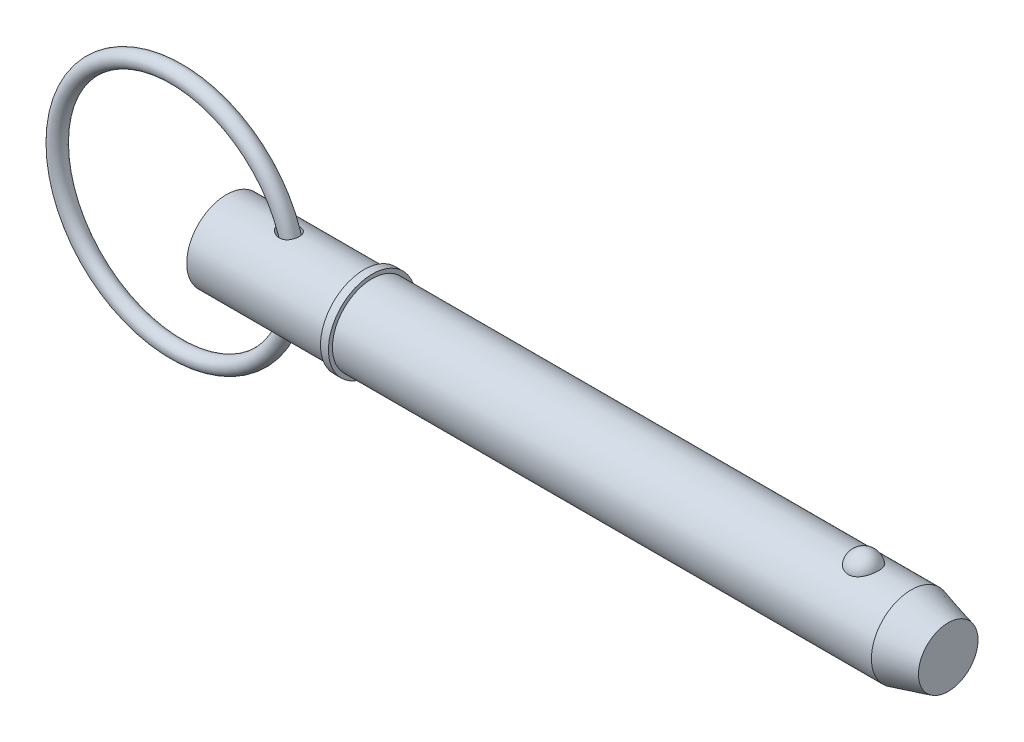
ISO-10303-21;
HEADER;
FILE_DESCRIPTION(('STEP AP214'),'2;1');
FILE_NAME('part.step','',(''),(''),'','','');
FILE_SCHEMA(('AUTOMOTIVE_DESIGN { 1 0 10303 214 1 1 1 1 }'));
ENDSEC;
DATA;
#1=APPLICATION_CONTEXT('core data for automotive mechanical design processes');
#2=APPLICATION_PROTOCOL_DEFINITION('international standard','automotive_design',2000,#1);
#3=PRODUCT_CONTEXT('',#1,'mechanical');
#4=PRODUCT('Part','Part','',(#3));
#5=PRODUCT_RELATED_PRODUCT_CATEGORY('part','',(#4));
#6=PRODUCT_DEFINITION_FORMATION('','',#4);
#7=PRODUCT_DEFINITION_CONTEXT('part definition',#1,'design');
#8=PRODUCT_DEFINITION('design','',#6,#7);
#9=PRODUCT_DEFINITION_SHAPE('','',#8);
#10=(LENGTH_UNIT() NAMED_UNIT(*) SI_UNIT(.MILLI.,.METRE.));
#11=(NAMED_UNIT(*) PLANE_ANGLE_UNIT() SI_UNIT($,.RADIAN.));
#12=(NAMED_UNIT(*) SI_UNIT($,.STERADIAN.) SOLID_ANGLE_UNIT());
#13=UNCERTAINTY_MEASURE_WITH_UNIT(LENGTH_MEASURE(1.E-05),#10,'distance_accuracy_value','');
#14=(GEOMETRIC_REPRESENTATION_CONTEXT(3) GLOBAL_UNCERTAINTY_ASSIGNED_CONTEXT((#13)) GLOBAL_UNIT_ASSIGNED_CONTEXT((#10,
#11,#12)) REPRESENTATION_CONTEXT('',''));
#15=CARTESIAN_POINT('',(0.,0.,0.));
#16=DIRECTION('',(0.,0.,1.));
#17=DIRECTION('',(1.,0.,0.));
#18=AXIS2_PLACEMENT_3D('',#15,#16,#17);
#19=CARTESIAN_POINT('',(-11.9894358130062,0.,0.));
#20=DIRECTION('',(0.,0.,1.));
#21=DIRECTION('',(1.,0.,0.));
#22=AXIS2_PLACEMENT_3D('',#19,#20,#21);
#23=TOROIDAL_SURFACE('',#22,28.575,1.905);
#24=CARTESIAN_POINT('',(18.4905641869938,0.,0.));
#25=VERTEX_POINT('',#24);
#26=VERTEX_LOOP('',#25);
#27=FACE_BOUND('',#26,.T.);
#28=ADVANCED_FACE('P0_F12',(#27),#23,.T.);
#29=CLOSED_SHELL('',(#28));
#30=MANIFOLD_SOLID_BREP('P0_B1',#29);
#31=CARTESIAN_POINT('',(0.,0.,0.));
#32=DIRECTION('',(1.,0.,0.));
#33=DIRECTION('',(0.,0.,-1.));
#34=AXIS2_PLACEMENT_3D('',#31,#32,#33);
#35=CYLINDRICAL_SURFACE('',#34,9.525);
#36=CARTESIAN_POINT('',(12.9513882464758,9.41921920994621,-1.41559473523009));
#37=CARTESIAN_POINT('',(13.0504692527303,9.40163924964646,-1.53256769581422));
#38=CARTESIAN_POINT('',(13.1602600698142,9.38319823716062,-1.64044593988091));
#39=CARTESIAN_POINT('',(13.3966485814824,9.34687220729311,-1.83618480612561));
#40=CARTESIAN_POINT('',(13.5232761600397,9.32898824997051,-1.92400906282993));
#41=CARTESIAN_POINT('',(13.78900694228,9.29593183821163,-2.07784697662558));
#42=CARTESIAN_POINT('',(13.9280753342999,9.28075215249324,-2.14391921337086));
#43=CARTESIAN_POINT('',(14.2153444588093,9.25488828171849,-2.25295850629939));
#44=CARTESIAN_POINT('',(14.3635415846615,9.24420233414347,-2.295934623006));
#45=CARTESIAN_POINT('',(14.669669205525,9.22859713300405,-2.3579005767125));
#46=CARTESIAN_POINT('',(14.8277567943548,9.22385123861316,-2.37617053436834));
#47=CARTESIAN_POINT('',(15.1447573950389,9.22170813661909,-2.38448481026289));
#48=CARTESIAN_POINT('',(15.3036699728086,9.22430739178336,-2.3745427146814));
#49=CARTESIAN_POINT('',(15.6046561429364,9.2363636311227,-2.32717331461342));
#50=CARTESIAN_POINT('',(15.7470893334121,9.24528216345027,-2.29190131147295));
#51=CARTESIAN_POINT('',(16.0228763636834,9.26842607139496,-2.19642882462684));
#52=CARTESIAN_POINT('',(16.1562346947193,9.28264879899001,-2.1362407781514));
#53=CARTESIAN_POINT('',(16.3991522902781,9.31332263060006,-1.99805318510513));
#54=CARTESIAN_POINT('',(16.5097585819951,9.32951023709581,-1.92182839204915));
#55=CARTESIAN_POINT('',(16.7159974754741,9.36298467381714,-1.75147176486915));
#56=CARTESIAN_POINT('',(16.811631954,9.38027136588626,-1.65734217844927));
#57=CARTESIAN_POINT('',(16.9833240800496,9.41356881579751,-1.45618916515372));
#58=CARTESIAN_POINT('',(17.0597719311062,9.42959946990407,-1.34950141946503));
#59=CARTESIAN_POINT('',(17.1939538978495,9.45905380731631,-1.1246201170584));
#60=CARTESIAN_POINT('',(17.2516877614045,9.4724774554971,-1.00642640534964));
#61=CARTESIAN_POINT('',(17.3474400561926,9.49535683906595,-0.760990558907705));
#62=CARTESIAN_POINT('',(17.3853184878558,9.50478431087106,-0.633691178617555));
#63=CARTESIAN_POINT('',(17.4399027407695,9.51852575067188,-0.374363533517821));
#64=CARTESIAN_POINT('',(17.4566077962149,9.52283953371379,-0.242335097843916));
#65=CARTESIAN_POINT('',(17.4685150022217,9.52590431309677,0.0235692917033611));
#66=CARTESIAN_POINT('',(17.4635842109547,9.52462091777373,0.157451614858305));
#67=CARTESIAN_POINT('',(17.4320243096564,9.5165501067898,0.422467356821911));
#68=CARTESIAN_POINT('',(17.4053947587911,9.50976257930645,0.553600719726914));
#69=CARTESIAN_POINT('',(17.3310009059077,9.49140797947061,0.809490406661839));
#70=CARTESIAN_POINT('',(17.2832204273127,9.47983724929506,0.93424176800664));
#71=CARTESIAN_POINT('',(17.1676219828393,9.45318034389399,1.1736825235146));
#72=CARTESIAN_POINT('',(17.0998044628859,9.43809424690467,1.28837214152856));
#73=CARTESIAN_POINT('',(16.9461013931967,9.40614962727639,1.50393386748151));
#74=CARTESIAN_POINT('',(16.8602910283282,9.38929862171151,1.6048606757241));
#75=CARTESIAN_POINT('',(16.6726759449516,9.35566510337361,1.79055313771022));
#76=CARTESIAN_POINT('',(16.5708731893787,9.33888258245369,1.87532077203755));
#77=CARTESIAN_POINT('',(16.3550631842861,9.30741331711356,2.02572386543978));
#78=CARTESIAN_POINT('',(16.2411701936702,9.29270956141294,2.09151983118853));
#79=CARTESIAN_POINT('',(16.0037488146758,9.26681293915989,2.20343355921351));
#80=CARTESIAN_POINT('',(15.8802207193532,9.25561996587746,2.24955191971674));
#81=CARTESIAN_POINT('',(15.6262451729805,9.23779438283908,2.32167613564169));
#82=CARTESIAN_POINT('',(15.4957570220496,9.23119272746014,2.34754561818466));
#83=CARTESIAN_POINT('',(15.2322153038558,9.22318493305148,2.37881082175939));
#84=CARTESIAN_POINT('',(15.0991611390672,9.22178001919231,2.3842017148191));
#85=CARTESIAN_POINT('',(14.8267609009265,9.22414647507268,2.37503099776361));
#86=CARTESIAN_POINT('',(14.6874545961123,9.22819578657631,2.35939810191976));
#87=CARTESIAN_POINT('',(14.412976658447,9.24129253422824,2.30756034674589));
#88=CARTESIAN_POINT('',(14.2778066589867,9.25034191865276,2.27134746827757));
#89=CARTESIAN_POINT('',(14.0027915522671,9.27334688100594,2.17561454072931));
#90=CARTESIAN_POINT('',(13.8635960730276,9.28766658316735,2.11431132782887));
#91=CARTESIAN_POINT('',(13.5969045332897,9.31925368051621,1.97041856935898));
#92=CARTESIAN_POINT('',(13.4694182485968,9.33652350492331,1.88781145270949));
#93=CARTESIAN_POINT('',(13.2243568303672,9.37286659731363,1.69844580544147));
#94=CARTESIAN_POINT('',(13.1075060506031,9.39198626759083,1.5907521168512));
#95=CARTESIAN_POINT('',(12.8957171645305,9.42881110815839,1.35544651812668));
#96=CARTESIAN_POINT('',(12.8007455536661,9.44651841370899,1.22786557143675));
#97=CARTESIAN_POINT('',(12.6580495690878,9.4741137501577,0.98872437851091));
#98=CARTESIAN_POINT('',(12.604453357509,9.4848570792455,0.880756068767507));
#99=CARTESIAN_POINT('',(12.515693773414,9.50295777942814,0.657225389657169));
#100=CARTESIAN_POINT('',(12.4805142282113,9.51031812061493,0.54166978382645));
#101=CARTESIAN_POINT('',(12.4305797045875,9.52083647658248,0.305475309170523));
#102=CARTESIAN_POINT('',(12.4159122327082,9.52397648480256,0.184816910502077));
#103=CARTESIAN_POINT('',(12.408320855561,9.52559626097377,-0.0572308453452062));
#104=CARTESIAN_POINT('',(12.4153963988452,9.52407614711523,-0.178620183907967));
#105=CARTESIAN_POINT('',(12.4495068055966,9.51684301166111,-0.409566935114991));
#106=CARTESIAN_POINT('',(12.4750931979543,9.51143444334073,-0.519353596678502));
#107=CARTESIAN_POINT('',(12.543120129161,9.49733710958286,-0.733285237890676));
#108=CARTESIAN_POINT('',(12.5855568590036,9.4886490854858,-0.837431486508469));
#109=CARTESIAN_POINT('',(12.6780792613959,9.47023833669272,-1.02356028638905));
#110=CARTESIAN_POINT('',(12.7261842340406,9.46084463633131,-1.10657511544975));
#111=CARTESIAN_POINT('',(12.8319313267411,9.44081892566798,-1.26610577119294));
#112=CARTESIAN_POINT('',(12.8895756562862,9.43018662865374,-1.34262008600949));
#113=CARTESIAN_POINT('',(12.9513882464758,9.41921920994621,-1.41559473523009));
#114=B_SPLINE_CURVE_WITH_KNOTS('',3,(#36,#37,#38,#39,#40,#41,#42,#43,#44,#45,#46,#47,#48,#49,
#50,#51,#52,#53,#54,#55,#56,#57,#58,#59,#60,#61,#62,#63,#64,#65,#66,#67,#68,#69,#70,#71,#72,#73,
#74,#75,#76,#77,#78,#79,#80,#81,#82,#83,#84,#85,#86,#87,#88,#89,#90,#91,#92,#93,#94,#95,#96,#97,
#98,#99,#100,#101,#102,#103,#104,#105,#106,#107,#108,#109,#110,#111,#112,#113),.UNSPECIFIED.,
.T.,.F.,(4,2,2,2,2,2,2,2,2,2,2,2,2,2,2,2,2,2,2,2,2,2,2,2,2,2,2,2,2,2,2,2,2,2,2,2,2,2,4),(0.,
0.462524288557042,0.925880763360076,1.3879789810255,1.84989578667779,2.32500103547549,
2.79987752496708,3.23851602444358,3.67693583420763,4.08084875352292,4.48471100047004,
4.87953549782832,5.27436531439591,5.67194282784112,6.0695347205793,6.46957303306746,
6.86961947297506,7.26997240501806,7.67031642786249,8.06901977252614,8.46767421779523,
8.86284969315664,9.25801315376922,9.65581560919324,10.0537118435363,10.4726706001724,
10.8917927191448,11.3481090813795,11.8048030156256,12.2824769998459,12.7594145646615,
13.1209614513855,13.4821903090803,13.8449555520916,14.2077115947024,14.5447865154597,
14.881785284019,15.170268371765,15.4588183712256),.UNSPECIFIED.);
#115=CARTESIAN_POINT('',(12.9513882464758,9.41921920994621,-1.41559473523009));
#116=VERTEX_POINT('',#115);
#117=EDGE_CURVE('P1_E42',#116,#116,#114,.T.);
#118=ORIENTED_EDGE('',*,*,#117,.T.);
#119=EDGE_LOOP('',(#118));
#120=FACE_BOUND('',#119,.T.);
#121=CARTESIAN_POINT('',(0.,0.,0.));
#122=DIRECTION('',(1.,0.,0.));
#123=DIRECTION('',(0.,0.,-1.));
#124=AXIS2_PLACEMENT_3D('',#121,#122,#123);
#125=CIRCLE('',#124,9.525);
#126=CARTESIAN_POINT('',(0.,0.,-9.525));
#127=VERTEX_POINT('',#126);
#128=EDGE_CURVE('P1_E9',#127,#127,#125,.T.);
#129=ORIENTED_EDGE('',*,*,#128,.T.);
#130=EDGE_LOOP('',(#129));
#131=FACE_BOUND('',#130,.T.);
#132=CARTESIAN_POINT('',(33.025,0.,0.));
#133=DIRECTION('',(1.,0.,0.));
#134=DIRECTION('',(0.,0.,-1.));
#135=AXIS2_PLACEMENT_3D('',#132,#133,#134);
#136=CIRCLE('',#135,9.525);
#137=CARTESIAN_POINT('',(33.025,0.,-9.525));
#138=VERTEX_POINT('',#137);
#139=EDGE_CURVE('P1_E25',#138,#138,#136,.T.);
#140=ORIENTED_EDGE('',*,*,#139,.F.);
#141=EDGE_LOOP('',(#140));
#142=FACE_BOUND('',#141,.T.);
#143=CARTESIAN_POINT('',(12.9513882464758,-9.41921920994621,-1.41559473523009));
#144=CARTESIAN_POINT('',(12.8706569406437,-9.43354320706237,-1.32028288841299));
#145=CARTESIAN_POINT('',(12.7970077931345,-9.44729974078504,-1.21890449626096));
#146=CARTESIAN_POINT('',(12.6667099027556,-9.47239055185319,-1.00546491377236));
#147=CARTESIAN_POINT('',(12.6100480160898,-9.48372669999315,-0.893412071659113));
#148=CARTESIAN_POINT('',(12.5163428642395,-9.50281544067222,-0.660202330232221));
#149=CARTESIAN_POINT('',(12.4794216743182,-9.51054569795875,-0.538993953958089));
#150=CARTESIAN_POINT('',(12.4282252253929,-9.52133525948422,-0.29167282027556));
#151=CARTESIAN_POINT('',(12.4139371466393,-9.52439720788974,-0.165562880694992));
#152=CARTESIAN_POINT('',(12.4092595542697,-9.52539668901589,0.0763263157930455));
#153=CARTESIAN_POINT('',(12.4169377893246,-9.5237485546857,0.192070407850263));
#154=CARTESIAN_POINT('',(12.4515961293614,-9.51640070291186,0.420478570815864));
#155=CARTESIAN_POINT('',(12.4785770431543,-9.51070081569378,0.533142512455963));
#156=CARTESIAN_POINT('',(12.5496371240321,-9.49599978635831,0.750537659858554));
#157=CARTESIAN_POINT('',(12.5934215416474,-9.48705569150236,0.855370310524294));
#158=CARTESIAN_POINT('',(12.6960201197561,-9.46670226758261,1.05710432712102));
#159=CARTESIAN_POINT('',(12.754838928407,-9.45529217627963,1.15400322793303));
#160=CARTESIAN_POINT('',(12.8926588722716,-9.42958102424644,1.34883014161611));
#161=CARTESIAN_POINT('',(12.9731843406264,-9.41509922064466,1.44565277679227));
#162=CARTESIAN_POINT('',(13.1473692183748,-9.38554264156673,1.62653953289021));
#163=CARTESIAN_POINT('',(13.2410364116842,-9.37046751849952,1.71059603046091));
#164=CARTESIAN_POINT('',(13.454392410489,-9.33867330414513,1.87697964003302));
#165=CARTESIAN_POINT('',(13.5758667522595,-9.32205896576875,1.95704323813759));
#166=CARTESIAN_POINT('',(13.8299208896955,-9.29140277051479,2.09777392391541));
#167=CARTESIAN_POINT('',(13.9625074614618,-9.27736250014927,2.15842906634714));
#168=CARTESIAN_POINT('',(14.2477938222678,-9.25234849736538,2.26337318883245));
#169=CARTESIAN_POINT('',(14.4012368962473,-9.2417532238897,2.30575283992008));
#170=CARTESIAN_POINT('',(14.7134258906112,-9.22706044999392,2.36387471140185));
#171=CARTESIAN_POINT('',(14.8721705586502,-9.22296142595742,2.37962317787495));
#172=CARTESIAN_POINT('',(15.1841930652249,-9.22219798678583,2.3825815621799));
#173=CARTESIAN_POINT('',(15.3374581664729,-9.22526675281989,2.37081567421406));
#174=CARTESIAN_POINT('',(15.6390558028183,-9.23821642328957,2.31984408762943));
#175=CARTESIAN_POINT('',(15.7873916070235,-9.24809271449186,2.28065697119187));
#176=CARTESIAN_POINT('',(16.0605055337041,-9.27231045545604,2.17997072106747));
#177=CARTESIAN_POINT('',(16.1861988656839,-9.28616347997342,2.12082794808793));
#178=CARTESIAN_POINT('',(16.4248737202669,-9.31689725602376,1.98144352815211));
#179=CARTESIAN_POINT('',(16.5378583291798,-9.33377726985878,1.90120701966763));
#180=CARTESIAN_POINT('',(16.7424913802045,-9.36766057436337,1.72629138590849));
#181=CARTESIAN_POINT('',(16.8349077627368,-9.38461836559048,1.63249912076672));
#182=CARTESIAN_POINT('',(17.0025959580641,-9.41752009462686,1.43052052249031));
#183=CARTESIAN_POINT('',(17.0778684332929,-9.43346407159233,1.32233474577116));
#184=CARTESIAN_POINT('',(17.2093311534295,-9.46256896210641,1.09477833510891));
#185=CARTESIAN_POINT('',(17.2655443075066,-9.47573320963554,0.975421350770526));
#186=CARTESIAN_POINT('',(17.3577240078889,-9.49788660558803,0.72876499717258));
#187=CARTESIAN_POINT('',(17.3936897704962,-9.5068755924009,0.601465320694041));
#188=CARTESIAN_POINT('',(17.4447894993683,-9.51977728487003,0.341392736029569));
#189=CARTESIAN_POINT('',(17.4597470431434,-9.52364698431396,0.208583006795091));
#190=CARTESIAN_POINT('',(17.467935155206,-9.52575588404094,-0.0577507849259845));
#191=CARTESIAN_POINT('',(17.4611651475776,-9.52399493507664,-0.191274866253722));
#192=CARTESIAN_POINT('',(17.4259933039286,-9.51501704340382,-0.455658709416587));
#193=CARTESIAN_POINT('',(17.3975278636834,-9.50778405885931,-0.586509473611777));
#194=CARTESIAN_POINT('',(17.3195245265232,-9.48862442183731,-0.841413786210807));
#195=CARTESIAN_POINT('',(17.2699864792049,-9.47669773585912,-0.965467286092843));
#196=CARTESIAN_POINT('',(17.1510794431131,-9.44947793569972,-1.20302860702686));
#197=CARTESIAN_POINT('',(17.0817421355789,-9.43419020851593,-1.31655289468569));
#198=CARTESIAN_POINT('',(16.9249035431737,-9.40193593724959,-1.52999797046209));
#199=CARTESIAN_POINT('',(16.8374037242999,-9.38496952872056,-1.62991985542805));
#200=CARTESIAN_POINT('',(16.6472525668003,-9.35139745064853,-1.81261591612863));
#201=CARTESIAN_POINT('',(16.544718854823,-9.33479003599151,-1.89551219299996));
#202=CARTESIAN_POINT('',(16.3268885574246,-9.30366076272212,-2.04284430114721));
#203=CARTESIAN_POINT('',(16.2115933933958,-9.28913867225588,-2.10728218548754));
#204=CARTESIAN_POINT('',(15.9721327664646,-9.26380878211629,-2.21598517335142));
#205=CARTESIAN_POINT('',(15.8480095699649,-9.25298455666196,-2.26033977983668));
#206=CARTESIAN_POINT('',(15.5939970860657,-9.23601616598,-2.32870721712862));
#207=CARTESIAN_POINT('',(15.4641070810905,-9.22987258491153,-2.35271750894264));
#208=CARTESIAN_POINT('',(15.1982340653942,-9.22261892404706,-2.38099747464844));
#209=CARTESIAN_POINT('',(15.0621840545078,-9.22166165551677,-2.38466791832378));
#210=CARTESIAN_POINT('',(14.7911713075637,-9.22504733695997,-2.37153091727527));
#211=CARTESIAN_POINT('',(14.6562088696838,-9.22939169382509,-2.35471803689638));
#212=CARTESIAN_POINT('',(14.3799999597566,-9.24325361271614,-2.29972931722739));
#213=CARTESIAN_POINT('',(14.2390842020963,-9.25314817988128,-2.25998976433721));
#214=CARTESIAN_POINT('',(13.9651910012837,-9.2770918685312,-2.15959208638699));
#215=CARTESIAN_POINT('',(13.8322212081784,-9.29114491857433,-2.09891417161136));
#216=CARTESIAN_POINT('',(13.5621642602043,-9.32369066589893,-1.94960068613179));
#217=CARTESIAN_POINT('',(13.4264724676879,-9.34251276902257,-1.85849626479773));
#218=CARTESIAN_POINT('',(13.1736579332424,-9.38095091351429,-1.6535412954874));
#219=CARTESIAN_POINT('',(13.0565182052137,-9.40056620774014,-1.53971177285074));
#220=CARTESIAN_POINT('',(12.9513882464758,-9.41921920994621,-1.41559473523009));
#221=B_SPLINE_CURVE_WITH_KNOTS('',3,(#143,#144,#145,#146,#147,#148,#149,#150,#151,#152,#153,
#154,#155,#156,#157,#158,#159,#160,#161,#162,#163,#164,#165,#166,#167,#168,#169,#170,#171,#172,
#173,#174,#175,#176,#177,#178,#179,#180,#181,#182,#183,#184,#185,#186,#187,#188,#189,#190,#191,
#192,#193,#194,#195,#196,#197,#198,#199,#200,#201,#202,#203,#204,#205,#206,#207,#208,#209,#210,
#211,#212,#213,#214,#215,#216,#217,#218,#219,#220),.UNSPECIFIED.,.T.,.F.,(4,2,2,2,2,2,2,2,2,2,2,
2,2,2,2,2,2,2,2,2,2,2,2,2,2,2,2,2,2,2,2,2,2,2,2,2,2,2,4),(0.,0.37674646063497,0.753200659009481,
1.13195666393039,1.51049805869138,1.85679105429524,2.20309856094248,2.54359033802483,
2.88418751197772,3.26301611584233,3.64207005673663,4.07954912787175,4.51729693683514,
4.99355673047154,5.46970480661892,5.92841231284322,6.38680927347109,6.80346940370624,
7.2200281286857,7.61642768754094,8.01281192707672,8.4087180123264,8.8046394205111,
9.20386620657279,9.60310357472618,10.0035159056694,10.4039310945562,10.8037091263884,
11.2034549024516,11.6002252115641,11.9969513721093,12.3918916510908,12.7868812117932,
13.1934480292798,13.6001227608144,14.038511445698,14.4773156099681,14.9683748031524,
15.4589817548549),.UNSPECIFIED.);
#222=CARTESIAN_POINT('',(12.9513882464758,-9.41921920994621,-1.41559473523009));
#223=VERTEX_POINT('',#222);
#224=EDGE_CURVE('P1_E17',#223,#223,#221,.T.);
#225=ORIENTED_EDGE('',*,*,#224,.T.);
#226=EDGE_LOOP('',(#225));
#227=FACE_BOUND('',#226,.T.);
#228=ADVANCED_FACE('P1_F13',(#120,#131,#142,#227),#35,.T.);
#229=CARTESIAN_POINT('',(0.,0.,0.));
#230=DIRECTION('',(1.,0.,0.));
#231=DIRECTION('',(0.,0.,-1.));
#232=AXIS2_PLACEMENT_3D('',#229,#230,#231);
#233=CYLINDRICAL_SURFACE('',#232,9.525);
#234=CARTESIAN_POINT('',(164.143054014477,0.,0.));
#235=DIRECTION('',(1.,0.,0.));
#236=DIRECTION('',(0.,0.,-1.));
#237=AXIS2_PLACEMENT_3D('',#234,#235,#236);
#238=CIRCLE('',#237,9.525);
#239=CARTESIAN_POINT('',(164.143054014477,0.,-9.525));
#240=VERTEX_POINT('',#239);
#241=EDGE_CURVE('P1_E99',#240,#240,#238,.T.);
#242=ORIENTED_EDGE('',*,*,#241,.F.);
#243=EDGE_LOOP('',(#242));
#244=FACE_BOUND('',#243,.T.);
#245=CARTESIAN_POINT('',(34.93,0.,0.));
#246=DIRECTION('',(1.,0.,0.));
#247=DIRECTION('',(0.,0.,-1.));
#248=AXIS2_PLACEMENT_3D('',#245,#246,#247);
#249=CIRCLE('',#248,9.525);
#250=CARTESIAN_POINT('',(34.93,0.,-9.525));
#251=VERTEX_POINT('',#250);
#252=EDGE_CURVE('P1_E96',#251,#251,#249,.T.);
#253=ORIENTED_EDGE('',*,*,#252,.T.);
#254=EDGE_LOOP('',(#253));
#255=FACE_BOUND('',#254,.T.);
#256=CARTESIAN_POINT('',(152.745757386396,8.80405803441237,3.63513233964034));
#257=CARTESIAN_POINT('',(152.651676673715,8.80405953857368,3.63513053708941));
#258=CARTESIAN_POINT('',(152.557561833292,8.80561325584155,3.63137461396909));
#259=CARTESIAN_POINT('',(152.370012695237,8.8117774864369,3.61638665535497));
#260=CARTESIAN_POINT('',(152.276578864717,8.81638992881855,3.60514990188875));
#261=CARTESIAN_POINT('',(151.997945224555,8.83467114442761,3.56024627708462));
#262=CARTESIAN_POINT('',(151.814691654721,8.85278327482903,3.5153862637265));
#263=CARTESIAN_POINT('',(151.459509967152,8.89871214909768,3.39742145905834));
#264=CARTESIAN_POINT('',(151.287553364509,8.92650327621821,3.32439116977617));
#265=CARTESIAN_POINT('',(150.958707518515,8.9887481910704,3.15220244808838));
#266=CARTESIAN_POINT('',(150.801811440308,9.02319893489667,3.05305594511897));
#267=CARTESIAN_POINT('',(150.502214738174,9.09629186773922,2.82797815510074));
#268=CARTESIAN_POINT('',(150.360060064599,9.13502685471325,2.70135138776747));
#269=CARTESIAN_POINT('',(150.098299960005,9.21186572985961,2.42641932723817));
#270=CARTESIAN_POINT('',(149.978701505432,9.24996941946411,2.27810735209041));
#271=CARTESIAN_POINT('',(149.759645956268,9.32341082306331,1.95652290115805));
#272=CARTESIAN_POINT('',(149.661317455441,9.35855090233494,1.78243511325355));
#273=CARTESIAN_POINT('',(149.493819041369,9.42045142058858,1.419372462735));
#274=CARTESIAN_POINT('',(149.424651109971,9.44721128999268,1.23039658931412));
#275=CARTESIAN_POINT('',(149.316199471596,9.48990641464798,0.840370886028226));
#276=CARTESIAN_POINT('',(149.277288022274,9.50570658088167,0.639202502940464));
#277=CARTESIAN_POINT('',(149.231555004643,9.52433146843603,0.232664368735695));
#278=CARTESIAN_POINT('',(149.224732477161,9.52715657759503,0.0272947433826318));
#279=CARTESIAN_POINT('',(149.243255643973,9.51956918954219,-0.380478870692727));
#280=CARTESIAN_POINT('',(149.268405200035,9.50923740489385,-0.582893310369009));
#281=CARTESIAN_POINT('',(149.35002537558,9.47651897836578,-0.980293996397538));
#282=CARTESIAN_POINT('',(149.406496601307,9.45413210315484,-1.17528009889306));
#283=CARTESIAN_POINT('',(149.549719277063,9.39954044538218,-1.55263697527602));
#284=CARTESIAN_POINT('',(149.636512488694,9.36732213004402,-1.73498993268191));
#285=CARTESIAN_POINT('',(149.838610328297,9.29640700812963,-2.08177763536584));
#286=CARTESIAN_POINT('',(149.953917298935,9.25770966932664,-2.24621090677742));
#287=CARTESIAN_POINT('',(150.211264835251,9.17775604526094,-2.5533833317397));
#288=CARTESIAN_POINT('',(150.353434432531,9.136488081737,-2.696011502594));
#289=CARTESIAN_POINT('',(150.66089985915,9.05620497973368,-2.95451229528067));
#290=CARTESIAN_POINT('',(150.826193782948,9.01718965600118,-3.07038711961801));
#291=CARTESIAN_POINT('',(151.172052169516,8.94680019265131,-3.26976836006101));
#292=CARTESIAN_POINT('',(151.352227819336,8.91528408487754,-3.35389750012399));
#293=CARTESIAN_POINT('',(151.725651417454,8.86272514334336,-3.49043503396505));
#294=CARTESIAN_POINT('',(151.918894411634,8.84167836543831,-3.54285537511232));
#295=CARTESIAN_POINT('',(152.302503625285,8.81348056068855,-3.61241306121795));
#296=CARTESIAN_POINT('',(152.492525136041,8.80568348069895,-3.6311933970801));
#297=CARTESIAN_POINT('',(152.873190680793,8.80289410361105,-3.63795342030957));
#298=CARTESIAN_POINT('',(153.063834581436,8.80789922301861,-3.62593932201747));
#299=CARTESIAN_POINT('',(153.434007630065,8.82974915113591,-3.57238430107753));
#300=CARTESIAN_POINT('',(153.613697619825,8.84621463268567,-3.53178890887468));
#301=CARTESIAN_POINT('',(153.963422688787,8.88875330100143,-3.42331083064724));
#302=CARTESIAN_POINT('',(154.133456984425,8.91482726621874,-3.35542593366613));
#303=CARTESIAN_POINT('',(154.463237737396,8.97448239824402,-3.19248225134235));
#304=CARTESIAN_POINT('',(154.622680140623,9.00821446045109,-3.0968647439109));
#305=CARTESIAN_POINT('',(154.923513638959,9.07935398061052,-2.88162736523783));
#306=CARTESIAN_POINT('',(155.064900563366,9.11676228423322,-2.76200196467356));
#307=CARTESIAN_POINT('',(155.33331931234,9.19347419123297,-2.49516285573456));
#308=CARTESIAN_POINT('',(155.459275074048,9.23277872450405,-2.34686614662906));
#309=CARTESIAN_POINT('',(155.685522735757,9.30737610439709,-2.03093683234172));
#310=CARTESIAN_POINT('',(155.78581004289,9.34266823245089,-1.86330077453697));
#311=CARTESIAN_POINT('',(155.961514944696,9.40674710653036,-1.50744893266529));
#312=CARTESIAN_POINT('',(156.036041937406,9.43529176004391,-1.31874876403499));
#313=CARTESIAN_POINT('',(156.15416505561,9.48144132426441,-0.930631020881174));
#314=CARTESIAN_POINT('',(156.197760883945,9.49904612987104,-0.731213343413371));
#315=CARTESIAN_POINT('',(156.253158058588,9.52153148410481,-0.327147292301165));
#316=CARTESIAN_POINT('',(156.264935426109,9.52640243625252,-0.122495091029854));
#317=CARTESIAN_POINT('',(156.256382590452,9.5228957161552,0.286018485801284));
#318=CARTESIAN_POINT('',(156.23605305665,9.5145183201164,0.489879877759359));
#319=CARTESIAN_POINT('',(156.163884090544,9.48544083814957,0.88999431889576));
#320=CARTESIAN_POINT('',(156.112199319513,9.46480124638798,1.08627971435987));
#321=CARTESIAN_POINT('',(155.978491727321,9.4133389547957,1.46682086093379));
#322=CARTESIAN_POINT('',(155.896466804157,9.38251554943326,1.65107577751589));
#323=CARTESIAN_POINT('',(155.70319292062,9.31365636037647,2.00346348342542));
#324=CARTESIAN_POINT('',(155.591783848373,9.27558138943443,2.17150083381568));
#325=CARTESIAN_POINT('',(155.342294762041,9.19638714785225,2.48563115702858));
#326=CARTESIAN_POINT('',(155.204216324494,9.15526805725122,2.63172542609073));
#327=CARTESIAN_POINT('',(154.904843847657,9.07465393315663,2.89750997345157));
#328=CARTESIAN_POINT('',(154.743610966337,9.03515496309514,3.01726776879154));
#329=CARTESIAN_POINT('',(154.401613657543,8.96227564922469,3.22732920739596));
#330=CARTESIAN_POINT('',(154.220841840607,8.92889763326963,3.31762165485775));
#331=CARTESIAN_POINT('',(153.851445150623,8.8734538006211,3.46314419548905));
#332=CARTESIAN_POINT('',(153.66332371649,8.85102983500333,3.51950082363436));
#333=CARTESIAN_POINT('',(153.37578699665,8.82666967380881,3.57993683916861));
#334=CARTESIAN_POINT('',(153.279133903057,8.82009725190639,3.59606217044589));
#335=CARTESIAN_POINT('',(153.084677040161,8.81020897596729,3.62022512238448));
#336=CARTESIAN_POINT('',(152.986874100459,8.80689090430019,3.62826825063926));
#337=CARTESIAN_POINT('',(152.841224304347,8.80445615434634,3.63416760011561));
#338=CARTESIAN_POINT('',(152.793495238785,8.80405727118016,3.63513325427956));
#339=CARTESIAN_POINT('',(152.745757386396,8.80405803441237,3.63513233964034));
#340=B_SPLINE_CURVE_WITH_KNOTS('',3,(#256,#257,#258,#259,#260,#261,#262,#263,#264,#265,#266,
#267,#268,#269,#270,#271,#272,#273,#274,#275,#276,#277,#278,#279,#280,#281,#282,#283,#284,#285,
#286,#287,#288,#289,#290,#291,#292,#293,#294,#295,#296,#297,#298,#299,#300,#301,#302,#303,#304,
#305,#306,#307,#308,#309,#310,#311,#312,#313,#314,#315,#316,#317,#318,#319,#320,#321,#322,#323,
#324,#325,#326,#327,#328,#329,#330,#331,#332,#333,#334,#335,#336,#337,#338,#339),.UNSPECIFIED.,
.T.,.F.,(4,2,2,2,2,2,2,2,2,2,2,2,2,2,2,2,2,2,2,2,2,2,2,2,2,2,2,2,2,2,2,2,2,2,2,2,2,2,2,2,2,4),
(0.,0.282202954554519,0.564584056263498,1.13017050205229,1.69427128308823,2.25811483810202,
2.83836627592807,3.41879688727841,4.02497117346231,4.63118665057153,5.2447475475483,
5.85829010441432,6.46808687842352,7.07789545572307,7.68854723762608,8.29924920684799,
8.9129628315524,9.52662591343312,10.1275338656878,10.7282152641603,11.2986646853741,
11.8689989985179,12.4213015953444,12.973648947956,13.5380053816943,14.1024919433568,
14.6952986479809,15.2882113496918,15.8999469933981,16.5116885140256,17.1238909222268,
17.7360805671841,18.3452748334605,18.9545113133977,19.567138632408,20.179729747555,
20.7907316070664,21.4019653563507,21.9915938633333,22.2859053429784,22.5800161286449,
22.7232098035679),.UNSPECIFIED.);
#341=CARTESIAN_POINT('',(152.745757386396,8.80405803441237,3.63513233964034));
#342=VERTEX_POINT('',#341);
#343=EDGE_CURVE('P1_E34',#342,#342,#340,.T.);
#344=ORIENTED_EDGE('',*,*,#343,.T.);
#345=EDGE_LOOP('',(#344));
#346=FACE_BOUND('',#345,.T.);
#347=ADVANCED_FACE('P1_F46',(#244,#255,#346),#233,.T.);
#348=CARTESIAN_POINT('',(0.,0.,0.));
#349=DIRECTION('',(-1.,0.,0.));
#350=DIRECTION('',(0.,0.,1.));
#351=AXIS2_PLACEMENT_3D('',#348,#349,#350);
#352=PLANE('',#351);
#353=ORIENTED_EDGE('',*,*,#128,.F.);
#354=EDGE_LOOP('',(#353));
#355=FACE_BOUND('',#354,.T.);
#356=ADVANCED_FACE('P1_F15',(#355),#352,.T.);
#357=CARTESIAN_POINT('',(33.025,9.525,0.));
#358=DIRECTION('',(-1.,0.,0.));
#359=DIRECTION('',(0.,0.,1.));
#360=AXIS2_PLACEMENT_3D('',#357,#358,#359);
#361=PLANE('',#360);
#362=ORIENTED_EDGE('',*,*,#139,.T.);
#363=EDGE_LOOP('',(#362));
#364=FACE_BOUND('',#363,.T.);
#365=CARTESIAN_POINT('',(33.025,0.,0.));
#366=DIRECTION('',(1.,0.,0.));
#367=DIRECTION('',(0.,0.,-1.));
#368=AXIS2_PLACEMENT_3D('',#365,#366,#367);
#369=CIRCLE('',#368,10.4775);
#370=CARTESIAN_POINT('',(33.025,0.,-10.4775));
#371=VERTEX_POINT('',#370);
#372=EDGE_CURVE('P1_E30',#371,#371,#369,.T.);
#373=ORIENTED_EDGE('',*,*,#372,.F.);
#374=EDGE_LOOP('',(#373));
#375=FACE_BOUND('',#374,.T.);
#376=ADVANCED_FACE('P1_F81',(#364,#375),#361,.T.);
#377=CARTESIAN_POINT('',(0.,0.,0.));
#378=DIRECTION('',(1.,0.,0.));
#379=DIRECTION('',(0.,0.,-1.));
#380=AXIS2_PLACEMENT_3D('',#377,#378,#379);
#381=CYLINDRICAL_SURFACE('',#380,10.4775);
#382=ORIENTED_EDGE('',*,*,#372,.T.);
#383=EDGE_LOOP('',(#382));
#384=FACE_BOUND('',#383,.T.);
#385=CARTESIAN_POINT('',(34.93,0.,0.));
#386=DIRECTION('',(1.,0.,0.));
#387=DIRECTION('',(0.,0.,-1.));
#388=AXIS2_PLACEMENT_3D('',#385,#386,#387);
#389=CIRCLE('',#388,10.4775);
#390=CARTESIAN_POINT('',(34.93,0.,-10.4775));
#391=VERTEX_POINT('',#390);
#392=EDGE_CURVE('P1_E95',#391,#391,#389,.T.);
#393=ORIENTED_EDGE('',*,*,#392,.F.);
#394=EDGE_LOOP('',(#393));
#395=FACE_BOUND('',#394,.T.);
#396=ADVANCED_FACE('P1_F68',(#384,#395),#381,.T.);
#397=CARTESIAN_POINT('',(34.93,10.4775,0.));
#398=DIRECTION('',(1.,0.,0.));
#399=DIRECTION('',(0.,0.,-1.));
#400=AXIS2_PLACEMENT_3D('',#397,#398,#399);
#401=PLANE('',#400);
#402=ORIENTED_EDGE('',*,*,#392,.T.);
#403=EDGE_LOOP('',(#402));
#404=FACE_BOUND('',#403,.T.);
#405=ORIENTED_EDGE('',*,*,#252,.F.);
#406=EDGE_LOOP('',(#405));
#407=FACE_BOUND('',#406,.T.);
#408=ADVANCED_FACE('P1_F62',(#404,#407),#401,.T.);
#409=CARTESIAN_POINT('',(173.03,0.,0.));
#410=DIRECTION('',(-1.,0.,0.));
#411=DIRECTION('',(0.,0.,1.));
#412=AXIS2_PLACEMENT_3D('',#409,#410,#411);
#413=CONICAL_SURFACE('',#412,7.14375000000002,0.26179938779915);
#414=ORIENTED_EDGE('',*,*,#241,.T.);
#415=EDGE_LOOP('',(#414));
#416=FACE_BOUND('',#415,.T.);
#417=CARTESIAN_POINT('',(173.03,0.,0.));
#418=DIRECTION('',(1.,0.,0.));
#419=DIRECTION('',(0.,0.,-1.));
#420=AXIS2_PLACEMENT_3D('',#417,#418,#419);
#421=CIRCLE('',#420,7.14375000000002);
#422=CARTESIAN_POINT('',(173.03,0.,-7.14375000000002));
#423=VERTEX_POINT('',#422);
#424=EDGE_CURVE('P1_E41',#423,#423,#421,.T.);
#425=ORIENTED_EDGE('',*,*,#424,.F.);
#426=EDGE_LOOP('',(#425));
#427=FACE_BOUND('',#426,.T.);
#428=ADVANCED_FACE('P1_F59',(#416,#427),#413,.T.);
#429=CARTESIAN_POINT('',(173.03,7.14375000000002,0.));
#430=DIRECTION('',(1.,0.,0.));
#431=DIRECTION('',(0.,0.,-1.));
#432=AXIS2_PLACEMENT_3D('',#429,#430,#431);
#433=PLANE('',#432);
#434=ORIENTED_EDGE('',*,*,#424,.T.);
#435=EDGE_LOOP('',(#434));
#436=FACE_BOUND('',#435,.T.);
#437=ADVANCED_FACE('P1_F55',(#436),#433,.T.);
#438=CARTESIAN_POINT('',(152.745757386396,8.57249999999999,0.));
#439=DIRECTION('',(-1.,0.,0.));
#440=DIRECTION('',(0.,1.,0.));
#441=AXIS2_PLACEMENT_3D('',#438,#439,#440);
#442=SPHERICAL_SURFACE('',#441,3.64249999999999);
#443=ORIENTED_EDGE('',*,*,#343,.F.);
#444=EDGE_LOOP('',(#443));
#445=FACE_BOUND('',#444,.T.);
#446=ADVANCED_FACE('P1_F50',(#445),#442,.T.);
#447=CARTESIAN_POINT('',(-11.9894358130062,0.,0.));
#448=DIRECTION('',(0.,0.,1.));
#449=DIRECTION('',(1.,0.,0.));
#450=AXIS2_PLACEMENT_3D('',#447,#448,#449);
#451=TOROIDAL_SURFACE('',#450,28.575,2.38125);
#452=ORIENTED_EDGE('',*,*,#224,.F.);
#453=EDGE_LOOP('',(#452));
#454=FACE_BOUND('',#453,.T.);
#455=ORIENTED_EDGE('',*,*,#117,.F.);
#456=EDGE_LOOP('',(#455));
#457=FACE_BOUND('',#456,.T.);
#458=ADVANCED_FACE('P1_F54',(#454,#457),#451,.F.);
#459=CLOSED_SHELL('',(#228,#347,#356,#376,#396,#408,#428,#437,#446,#458));
#460=MANIFOLD_SOLID_BREP('P1_B1',#459);
#461=ADVANCED_BREP_SHAPE_REPRESENTATION('',(#18,#30,#460),#14);
#462=SHAPE_DEFINITION_REPRESENTATION(#9,#461);
ENDSEC;
END-ISO-10303-21;
